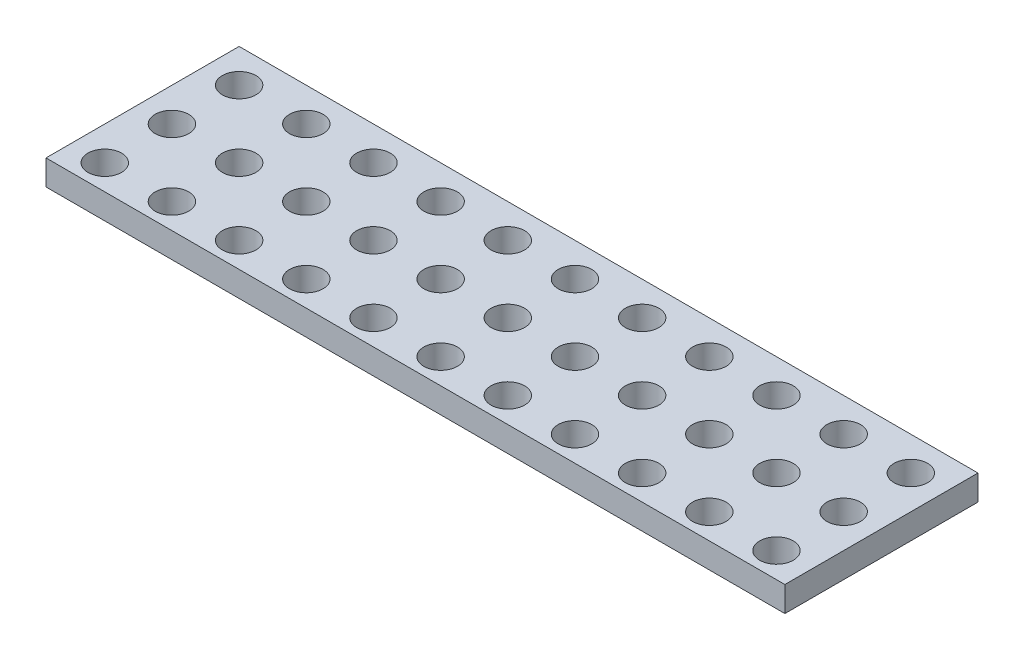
ISO-10303-21;
HEADER;
FILE_DESCRIPTION(('STEP AP214'),'2;1');
FILE_NAME('part.step','',(''),(''),'','','');
FILE_SCHEMA(('AUTOMOTIVE_DESIGN { 1 0 10303 214 1 1 1 1 }'));
ENDSEC;
DATA;
#1=APPLICATION_CONTEXT('core data for automotive mechanical design processes');
#2=APPLICATION_PROTOCOL_DEFINITION('international standard','automotive_design',2000,#1);
#3=PRODUCT_CONTEXT('',#1,'mechanical');
#4=PRODUCT('Part','Part','',(#3));
#5=PRODUCT_RELATED_PRODUCT_CATEGORY('part','',(#4));
#6=PRODUCT_DEFINITION_FORMATION('','',#4);
#7=PRODUCT_DEFINITION_CONTEXT('part definition',#1,'design');
#8=PRODUCT_DEFINITION('design','',#6,#7);
#9=PRODUCT_DEFINITION_SHAPE('','',#8);
#10=(LENGTH_UNIT() NAMED_UNIT(*) SI_UNIT(.MILLI.,.METRE.));
#11=(NAMED_UNIT(*) PLANE_ANGLE_UNIT() SI_UNIT($,.RADIAN.));
#12=(NAMED_UNIT(*) SI_UNIT($,.STERADIAN.) SOLID_ANGLE_UNIT());
#13=UNCERTAINTY_MEASURE_WITH_UNIT(LENGTH_MEASURE(1.E-05),#10,'distance_accuracy_value','');
#14=(GEOMETRIC_REPRESENTATION_CONTEXT(3) GLOBAL_UNCERTAINTY_ASSIGNED_CONTEXT((#13)) GLOBAL_UNIT_ASSIGNED_CONTEXT((#10,
#11,#12)) REPRESENTATION_CONTEXT('',''));
#15=CARTESIAN_POINT('',(0.,0.,0.));
#16=DIRECTION('',(0.,0.,1.));
#17=DIRECTION('',(1.,0.,0.));
#18=AXIS2_PLACEMENT_3D('',#15,#16,#17);
#19=CARTESIAN_POINT('',(0.,3.,0.));
#20=DIRECTION('',(0.,1.,0.));
#21=DIRECTION('',(0.,0.,1.));
#22=AXIS2_PLACEMENT_3D('',#19,#20,#21);
#23=PLANE('',#22);
#24=CARTESIAN_POINT('',(59.4074074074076,3.,8.29629629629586));
#25=DIRECTION('',(0.,1.,0.));
#26=DIRECTION('',(0.,0.,1.));
#27=AXIS2_PLACEMENT_3D('',#24,#25,#26);
#28=CIRCLE('',#27,2.);
#29=CARTESIAN_POINT('',(59.4074074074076,3.,10.2962962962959));
#30=VERTEX_POINT('',#29);
#31=EDGE_CURVE('E297',#30,#30,#28,.T.);
#32=ORIENTED_EDGE('',*,*,#31,.F.);
#33=EDGE_LOOP('',(#32));
#34=FACE_BOUND('',#33,.T.);
#35=CARTESIAN_POINT('',(43.4074074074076,3.,8.29629629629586));
#36=DIRECTION('',(0.,1.,0.));
#37=DIRECTION('',(0.,0.,1.));
#38=AXIS2_PLACEMENT_3D('',#35,#36,#37);
#39=CIRCLE('',#38,2.);
#40=CARTESIAN_POINT('',(43.4074074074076,3.,10.2962962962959));
#41=VERTEX_POINT('',#40);
#42=EDGE_CURVE('E285',#41,#41,#39,.T.);
#43=ORIENTED_EDGE('',*,*,#42,.F.);
#44=EDGE_LOOP('',(#43));
#45=FACE_BOUND('',#44,.T.);
#46=CARTESIAN_POINT('',(27.4074074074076,3.,8.2962962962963));
#47=DIRECTION('',(0.,1.,0.));
#48=DIRECTION('',(0.,0.,1.));
#49=AXIS2_PLACEMENT_3D('',#46,#47,#48);
#50=CIRCLE('',#49,2.);
#51=CARTESIAN_POINT('',(27.4074074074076,3.,10.2962962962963));
#52=VERTEX_POINT('',#51);
#53=EDGE_CURVE('E273',#52,#52,#50,.T.);
#54=ORIENTED_EDGE('',*,*,#53,.F.);
#55=EDGE_LOOP('',(#54));
#56=FACE_BOUND('',#55,.T.);
#57=CARTESIAN_POINT('',(11.4074074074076,3.,8.2962962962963));
#58=DIRECTION('',(0.,1.,0.));
#59=DIRECTION('',(0.,0.,1.));
#60=AXIS2_PLACEMENT_3D('',#57,#58,#59);
#61=CIRCLE('',#60,2.);
#62=CARTESIAN_POINT('',(11.4074074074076,3.,10.2962962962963));
#63=VERTEX_POINT('',#62);
#64=EDGE_CURVE('E261',#63,#63,#61,.T.);
#65=ORIENTED_EDGE('',*,*,#64,.F.);
#66=EDGE_LOOP('',(#65));
#67=FACE_BOUND('',#66,.T.);
#68=CARTESIAN_POINT('',(-4.59259259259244,3.,8.2962962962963));
#69=DIRECTION('',(0.,1.,0.));
#70=DIRECTION('',(0.,0.,1.));
#71=AXIS2_PLACEMENT_3D('',#68,#69,#70);
#72=CIRCLE('',#71,2.);
#73=CARTESIAN_POINT('',(-4.59259259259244,3.,10.2962962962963));
#74=VERTEX_POINT('',#73);
#75=EDGE_CURVE('E249',#74,#74,#72,.T.);
#76=ORIENTED_EDGE('',*,*,#75,.F.);
#77=EDGE_LOOP('',(#76));
#78=FACE_BOUND('',#77,.T.);
#79=CARTESIAN_POINT('',(-20.5925925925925,3.,0.296296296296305));
#80=DIRECTION('',(0.,1.,0.));
#81=DIRECTION('',(0.,0.,1.));
#82=AXIS2_PLACEMENT_3D('',#79,#80,#81);
#83=CIRCLE('',#82,2.);
#84=CARTESIAN_POINT('',(-20.5925925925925,3.,2.29629629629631));
#85=VERTEX_POINT('',#84);
#86=EDGE_CURVE('E237',#85,#85,#83,.T.);
#87=ORIENTED_EDGE('',*,*,#86,.F.);
#88=EDGE_LOOP('',(#87));
#89=FACE_BOUND('',#88,.T.);
#90=CARTESIAN_POINT('',(51.4074074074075,3.,0.296296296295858));
#91=DIRECTION('',(0.,1.,0.));
#92=DIRECTION('',(0.,0.,1.));
#93=AXIS2_PLACEMENT_3D('',#90,#91,#92);
#94=CIRCLE('',#93,2.);
#95=CARTESIAN_POINT('',(51.4074074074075,3.,2.29629629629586));
#96=VERTEX_POINT('',#95);
#97=EDGE_CURVE('E225',#96,#96,#94,.T.);
#98=ORIENTED_EDGE('',*,*,#97,.F.);
#99=EDGE_LOOP('',(#98));
#100=FACE_BOUND('',#99,.T.);
#101=CARTESIAN_POINT('',(35.4074074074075,3.,0.296296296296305));
#102=DIRECTION('',(0.,1.,0.));
#103=DIRECTION('',(0.,0.,1.));
#104=AXIS2_PLACEMENT_3D('',#101,#102,#103);
#105=CIRCLE('',#104,2.);
#106=CARTESIAN_POINT('',(35.4074074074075,3.,2.29629629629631));
#107=VERTEX_POINT('',#106);
#108=EDGE_CURVE('E213',#107,#107,#105,.T.);
#109=ORIENTED_EDGE('',*,*,#108,.F.);
#110=EDGE_LOOP('',(#109));
#111=FACE_BOUND('',#110,.T.);
#112=CARTESIAN_POINT('',(19.4074074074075,3.,0.296296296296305));
#113=DIRECTION('',(0.,1.,0.));
#114=DIRECTION('',(0.,0.,1.));
#115=AXIS2_PLACEMENT_3D('',#112,#113,#114);
#116=CIRCLE('',#115,2.);
#117=CARTESIAN_POINT('',(19.4074074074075,3.,2.29629629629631));
#118=VERTEX_POINT('',#117);
#119=EDGE_CURVE('E201',#118,#118,#116,.T.);
#120=ORIENTED_EDGE('',*,*,#119,.F.);
#121=EDGE_LOOP('',(#120));
#122=FACE_BOUND('',#121,.T.);
#123=CARTESIAN_POINT('',(3.40740740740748,3.,0.296296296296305));
#124=DIRECTION('',(0.,1.,0.));
#125=DIRECTION('',(0.,0.,1.));
#126=AXIS2_PLACEMENT_3D('',#123,#124,#125);
#127=CIRCLE('',#126,2.);
#128=CARTESIAN_POINT('',(3.40740740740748,3.,2.29629629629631));
#129=VERTEX_POINT('',#128);
#130=EDGE_CURVE('E189',#129,#129,#127,.T.);
#131=ORIENTED_EDGE('',*,*,#130,.F.);
#132=EDGE_LOOP('',(#131));
#133=FACE_BOUND('',#132,.T.);
#134=CARTESIAN_POINT('',(-12.5925925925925,3.,0.296296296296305));
#135=DIRECTION('',(0.,1.,0.));
#136=DIRECTION('',(0.,0.,1.));
#137=AXIS2_PLACEMENT_3D('',#134,#135,#136);
#138=CIRCLE('',#137,2.);
#139=CARTESIAN_POINT('',(-12.5925925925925,3.,2.29629629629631));
#140=VERTEX_POINT('',#139);
#141=EDGE_CURVE('E177',#140,#140,#138,.T.);
#142=ORIENTED_EDGE('',*,*,#141,.F.);
#143=EDGE_LOOP('',(#142));
#144=FACE_BOUND('',#143,.T.);
#145=CARTESIAN_POINT('',(51.4074074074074,3.,-7.70370370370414));
#146=DIRECTION('',(0.,1.,0.));
#147=DIRECTION('',(0.,0.,1.));
#148=AXIS2_PLACEMENT_3D('',#145,#146,#147);
#149=CIRCLE('',#148,2.);
#150=CARTESIAN_POINT('',(51.4074074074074,3.,-5.70370370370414));
#151=VERTEX_POINT('',#150);
#152=EDGE_CURVE('E165',#151,#151,#149,.T.);
#153=ORIENTED_EDGE('',*,*,#152,.F.);
#154=EDGE_LOOP('',(#153));
#155=FACE_BOUND('',#154,.T.);
#156=CARTESIAN_POINT('',(35.4074074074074,3.,-7.7037037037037));
#157=DIRECTION('',(0.,1.,0.));
#158=DIRECTION('',(0.,0.,1.));
#159=AXIS2_PLACEMENT_3D('',#156,#157,#158);
#160=CIRCLE('',#159,2.);
#161=CARTESIAN_POINT('',(35.4074074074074,3.,-5.70370370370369));
#162=VERTEX_POINT('',#161);
#163=EDGE_CURVE('E153',#162,#162,#160,.T.);
#164=ORIENTED_EDGE('',*,*,#163,.F.);
#165=EDGE_LOOP('',(#164));
#166=FACE_BOUND('',#165,.T.);
#167=CARTESIAN_POINT('',(19.4074074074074,3.,-7.7037037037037));
#168=DIRECTION('',(0.,1.,0.));
#169=DIRECTION('',(0.,0.,1.));
#170=AXIS2_PLACEMENT_3D('',#167,#168,#169);
#171=CIRCLE('',#170,2.);
#172=CARTESIAN_POINT('',(19.4074074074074,3.,-5.70370370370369));
#173=VERTEX_POINT('',#172);
#174=EDGE_CURVE('E141',#173,#173,#171,.T.);
#175=ORIENTED_EDGE('',*,*,#174,.F.);
#176=EDGE_LOOP('',(#175));
#177=FACE_BOUND('',#176,.T.);
#178=CARTESIAN_POINT('',(3.40740740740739,3.,-7.7037037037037));
#179=DIRECTION('',(0.,1.,0.));
#180=DIRECTION('',(0.,0.,1.));
#181=AXIS2_PLACEMENT_3D('',#178,#179,#180);
#182=CIRCLE('',#181,2.);
#183=CARTESIAN_POINT('',(3.40740740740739,3.,-5.70370370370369));
#184=VERTEX_POINT('',#183);
#185=EDGE_CURVE('E129',#184,#184,#182,.T.);
#186=ORIENTED_EDGE('',*,*,#185,.F.);
#187=EDGE_LOOP('',(#186));
#188=FACE_BOUND('',#187,.T.);
#189=CARTESIAN_POINT('',(-12.5925925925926,3.,-7.7037037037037));
#190=DIRECTION('',(0.,1.,0.));
#191=DIRECTION('',(0.,0.,1.));
#192=AXIS2_PLACEMENT_3D('',#189,#190,#191);
#193=CIRCLE('',#192,2.);
#194=CARTESIAN_POINT('',(-12.5925925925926,3.,-5.70370370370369));
#195=VERTEX_POINT('',#194);
#196=EDGE_CURVE('E117',#195,#195,#193,.T.);
#197=ORIENTED_EDGE('',*,*,#196,.F.);
#198=EDGE_LOOP('',(#197));
#199=FACE_BOUND('',#198,.T.);
#200=DIRECTION('',(0.,0.,1.));
#201=VECTOR('',#200,1.);
#202=CARTESIAN_POINT('',(-24.5925925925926,3.,-11.7037037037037));
#203=LINE('',#202,#201);
#204=CARTESIAN_POINT('',(-24.5925925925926,3.,-11.7037037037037));
#205=VERTEX_POINT('',#204);
#206=CARTESIAN_POINT('',(-24.5925925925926,3.,11.2962962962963));
#207=VERTEX_POINT('',#206);
#208=EDGE_CURVE('E87',#205,#207,#203,.T.);
#209=ORIENTED_EDGE('',*,*,#208,.T.);
#210=DIRECTION('',(1.,0.,0.));
#211=VECTOR('',#210,1.);
#212=CARTESIAN_POINT('',(-24.5925925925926,3.,11.2962962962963));
#213=LINE('',#212,#211);
#214=CARTESIAN_POINT('',(63.4074074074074,3.,11.2962962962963));
#215=VERTEX_POINT('',#214);
#216=EDGE_CURVE('E82',#207,#215,#213,.T.);
#217=ORIENTED_EDGE('',*,*,#216,.T.);
#218=DIRECTION('',(0.,0.,-1.));
#219=VECTOR('',#218,1.);
#220=CARTESIAN_POINT('',(63.4074074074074,3.,-11.7037037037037));
#221=LINE('',#220,#219);
#222=CARTESIAN_POINT('',(63.4074074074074,3.,-11.7037037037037));
#223=VERTEX_POINT('',#222);
#224=EDGE_CURVE('E85',#215,#223,#221,.T.);
#225=ORIENTED_EDGE('',*,*,#224,.T.);
#226=DIRECTION('',(-1.,0.,0.));
#227=VECTOR('',#226,1.);
#228=CARTESIAN_POINT('',(-24.5925925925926,3.,-11.7037037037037));
#229=LINE('',#228,#227);
#230=EDGE_CURVE('E52',#223,#205,#229,.T.);
#231=ORIENTED_EDGE('',*,*,#230,.T.);
#232=EDGE_LOOP('',(#209,#217,#225,#231));
#233=FACE_BOUND('',#232,.T.);
#234=CARTESIAN_POINT('',(-20.5925925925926,3.,-7.7037037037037));
#235=DIRECTION('',(0.,1.,0.));
#236=DIRECTION('',(0.,0.,1.));
#237=AXIS2_PLACEMENT_3D('',#234,#235,#236);
#238=CIRCLE('',#237,2.);
#239=CARTESIAN_POINT('',(-20.5925925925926,3.,-5.70370370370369));
#240=VERTEX_POINT('',#239);
#241=EDGE_CURVE('E102',#240,#240,#238,.T.);
#242=ORIENTED_EDGE('',*,*,#241,.F.);
#243=EDGE_LOOP('',(#242));
#244=FACE_BOUND('',#243,.T.);
#245=CARTESIAN_POINT('',(-4.59259259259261,3.,-7.7037037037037));
#246=DIRECTION('',(0.,1.,0.));
#247=DIRECTION('',(0.,0.,1.));
#248=AXIS2_PLACEMENT_3D('',#245,#246,#247);
#249=CIRCLE('',#248,2.);
#250=CARTESIAN_POINT('',(-4.59259259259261,3.,-5.70370370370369));
#251=VERTEX_POINT('',#250);
#252=EDGE_CURVE('E123',#251,#251,#249,.T.);
#253=ORIENTED_EDGE('',*,*,#252,.F.);
#254=EDGE_LOOP('',(#253));
#255=FACE_BOUND('',#254,.T.);
#256=CARTESIAN_POINT('',(11.4074074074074,3.,-7.7037037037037));
#257=DIRECTION('',(0.,1.,0.));
#258=DIRECTION('',(0.,0.,1.));
#259=AXIS2_PLACEMENT_3D('',#256,#257,#258);
#260=CIRCLE('',#259,2.);
#261=CARTESIAN_POINT('',(11.4074074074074,3.,-5.70370370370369));
#262=VERTEX_POINT('',#261);
#263=EDGE_CURVE('E135',#262,#262,#260,.T.);
#264=ORIENTED_EDGE('',*,*,#263,.F.);
#265=EDGE_LOOP('',(#264));
#266=FACE_BOUND('',#265,.T.);
#267=CARTESIAN_POINT('',(27.4074074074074,3.,-7.7037037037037));
#268=DIRECTION('',(0.,1.,0.));
#269=DIRECTION('',(0.,0.,1.));
#270=AXIS2_PLACEMENT_3D('',#267,#268,#269);
#271=CIRCLE('',#270,2.);
#272=CARTESIAN_POINT('',(27.4074074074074,3.,-5.70370370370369));
#273=VERTEX_POINT('',#272);
#274=EDGE_CURVE('E147',#273,#273,#271,.T.);
#275=ORIENTED_EDGE('',*,*,#274,.F.);
#276=EDGE_LOOP('',(#275));
#277=FACE_BOUND('',#276,.T.);
#278=CARTESIAN_POINT('',(43.4074074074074,3.,-7.70370370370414));
#279=DIRECTION('',(0.,1.,0.));
#280=DIRECTION('',(0.,0.,1.));
#281=AXIS2_PLACEMENT_3D('',#278,#279,#280);
#282=CIRCLE('',#281,2.);
#283=CARTESIAN_POINT('',(43.4074074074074,3.,-5.70370370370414));
#284=VERTEX_POINT('',#283);
#285=EDGE_CURVE('E159',#284,#284,#282,.T.);
#286=ORIENTED_EDGE('',*,*,#285,.F.);
#287=EDGE_LOOP('',(#286));
#288=FACE_BOUND('',#287,.T.);
#289=CARTESIAN_POINT('',(59.4074074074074,3.,-7.70370370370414));
#290=DIRECTION('',(0.,1.,0.));
#291=DIRECTION('',(0.,0.,1.));
#292=AXIS2_PLACEMENT_3D('',#289,#290,#291);
#293=CIRCLE('',#292,2.);
#294=CARTESIAN_POINT('',(59.4074074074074,3.,-5.70370370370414));
#295=VERTEX_POINT('',#294);
#296=EDGE_CURVE('E171',#295,#295,#293,.T.);
#297=ORIENTED_EDGE('',*,*,#296,.F.);
#298=EDGE_LOOP('',(#297));
#299=FACE_BOUND('',#298,.T.);
#300=CARTESIAN_POINT('',(-4.59259259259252,3.,0.296296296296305));
#301=DIRECTION('',(0.,1.,0.));
#302=DIRECTION('',(0.,0.,1.));
#303=AXIS2_PLACEMENT_3D('',#300,#301,#302);
#304=CIRCLE('',#303,2.);
#305=CARTESIAN_POINT('',(-4.59259259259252,3.,2.29629629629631));
#306=VERTEX_POINT('',#305);
#307=EDGE_CURVE('E183',#306,#306,#304,.T.);
#308=ORIENTED_EDGE('',*,*,#307,.F.);
#309=EDGE_LOOP('',(#308));
#310=FACE_BOUND('',#309,.T.);
#311=CARTESIAN_POINT('',(11.4074074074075,3.,0.296296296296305));
#312=DIRECTION('',(0.,1.,0.));
#313=DIRECTION('',(0.,0.,1.));
#314=AXIS2_PLACEMENT_3D('',#311,#312,#313);
#315=CIRCLE('',#314,2.);
#316=CARTESIAN_POINT('',(11.4074074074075,3.,2.29629629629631));
#317=VERTEX_POINT('',#316);
#318=EDGE_CURVE('E195',#317,#317,#315,.T.);
#319=ORIENTED_EDGE('',*,*,#318,.F.);
#320=EDGE_LOOP('',(#319));
#321=FACE_BOUND('',#320,.T.);
#322=CARTESIAN_POINT('',(27.4074074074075,3.,0.296296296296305));
#323=DIRECTION('',(0.,1.,0.));
#324=DIRECTION('',(0.,0.,1.));
#325=AXIS2_PLACEMENT_3D('',#322,#323,#324);
#326=CIRCLE('',#325,2.);
#327=CARTESIAN_POINT('',(27.4074074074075,3.,2.29629629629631));
#328=VERTEX_POINT('',#327);
#329=EDGE_CURVE('E207',#328,#328,#326,.T.);
#330=ORIENTED_EDGE('',*,*,#329,.F.);
#331=EDGE_LOOP('',(#330));
#332=FACE_BOUND('',#331,.T.);
#333=CARTESIAN_POINT('',(43.4074074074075,3.,0.296296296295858));
#334=DIRECTION('',(0.,1.,0.));
#335=DIRECTION('',(0.,0.,1.));
#336=AXIS2_PLACEMENT_3D('',#333,#334,#335);
#337=CIRCLE('',#336,2.);
#338=CARTESIAN_POINT('',(43.4074074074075,3.,2.29629629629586));
#339=VERTEX_POINT('',#338);
#340=EDGE_CURVE('E219',#339,#339,#337,.T.);
#341=ORIENTED_EDGE('',*,*,#340,.F.);
#342=EDGE_LOOP('',(#341));
#343=FACE_BOUND('',#342,.T.);
#344=CARTESIAN_POINT('',(59.4074074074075,3.,0.296296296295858));
#345=DIRECTION('',(0.,1.,0.));
#346=DIRECTION('',(0.,0.,1.));
#347=AXIS2_PLACEMENT_3D('',#344,#345,#346);
#348=CIRCLE('',#347,2.);
#349=CARTESIAN_POINT('',(59.4074074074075,3.,2.29629629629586));
#350=VERTEX_POINT('',#349);
#351=EDGE_CURVE('E231',#350,#350,#348,.T.);
#352=ORIENTED_EDGE('',*,*,#351,.F.);
#353=EDGE_LOOP('',(#352));
#354=FACE_BOUND('',#353,.T.);
#355=CARTESIAN_POINT('',(-12.5925925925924,3.,8.2962962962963));
#356=DIRECTION('',(0.,1.,0.));
#357=DIRECTION('',(0.,0.,1.));
#358=AXIS2_PLACEMENT_3D('',#355,#356,#357);
#359=CIRCLE('',#358,2.);
#360=CARTESIAN_POINT('',(-12.5925925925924,3.,10.2962962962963));
#361=VERTEX_POINT('',#360);
#362=EDGE_CURVE('E243',#361,#361,#359,.T.);
#363=ORIENTED_EDGE('',*,*,#362,.F.);
#364=EDGE_LOOP('',(#363));
#365=FACE_BOUND('',#364,.T.);
#366=CARTESIAN_POINT('',(3.40740740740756,3.,8.2962962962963));
#367=DIRECTION('',(0.,1.,0.));
#368=DIRECTION('',(0.,0.,1.));
#369=AXIS2_PLACEMENT_3D('',#366,#367,#368);
#370=CIRCLE('',#369,2.);
#371=CARTESIAN_POINT('',(3.40740740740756,3.,10.2962962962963));
#372=VERTEX_POINT('',#371);
#373=EDGE_CURVE('E255',#372,#372,#370,.T.);
#374=ORIENTED_EDGE('',*,*,#373,.F.);
#375=EDGE_LOOP('',(#374));
#376=FACE_BOUND('',#375,.T.);
#377=CARTESIAN_POINT('',(19.4074074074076,3.,8.2962962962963));
#378=DIRECTION('',(0.,1.,0.));
#379=DIRECTION('',(0.,0.,1.));
#380=AXIS2_PLACEMENT_3D('',#377,#378,#379);
#381=CIRCLE('',#380,2.);
#382=CARTESIAN_POINT('',(19.4074074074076,3.,10.2962962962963));
#383=VERTEX_POINT('',#382);
#384=EDGE_CURVE('E267',#383,#383,#381,.T.);
#385=ORIENTED_EDGE('',*,*,#384,.F.);
#386=EDGE_LOOP('',(#385));
#387=FACE_BOUND('',#386,.T.);
#388=CARTESIAN_POINT('',(35.4074074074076,3.,8.2962962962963));
#389=DIRECTION('',(0.,1.,0.));
#390=DIRECTION('',(0.,0.,1.));
#391=AXIS2_PLACEMENT_3D('',#388,#389,#390);
#392=CIRCLE('',#391,2.);
#393=CARTESIAN_POINT('',(35.4074074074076,3.,10.2962962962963));
#394=VERTEX_POINT('',#393);
#395=EDGE_CURVE('E279',#394,#394,#392,.T.);
#396=ORIENTED_EDGE('',*,*,#395,.F.);
#397=EDGE_LOOP('',(#396));
#398=FACE_BOUND('',#397,.T.);
#399=CARTESIAN_POINT('',(51.4074074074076,3.,8.29629629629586));
#400=DIRECTION('',(0.,1.,0.));
#401=DIRECTION('',(0.,0.,1.));
#402=AXIS2_PLACEMENT_3D('',#399,#400,#401);
#403=CIRCLE('',#402,2.);
#404=CARTESIAN_POINT('',(51.4074074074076,3.,10.2962962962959));
#405=VERTEX_POINT('',#404);
#406=EDGE_CURVE('E291',#405,#405,#403,.T.);
#407=ORIENTED_EDGE('',*,*,#406,.F.);
#408=EDGE_LOOP('',(#407));
#409=FACE_BOUND('',#408,.T.);
#410=CARTESIAN_POINT('',(-20.5925925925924,3.,8.2962962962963));
#411=DIRECTION('',(0.,1.,0.));
#412=DIRECTION('',(0.,0.,1.));
#413=AXIS2_PLACEMENT_3D('',#410,#411,#412);
#414=CIRCLE('',#413,2.);
#415=CARTESIAN_POINT('',(-20.5925925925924,3.,10.2962962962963));
#416=VERTEX_POINT('',#415);
#417=EDGE_CURVE('E303',#416,#416,#414,.T.);
#418=ORIENTED_EDGE('',*,*,#417,.F.);
#419=EDGE_LOOP('',(#418));
#420=FACE_BOUND('',#419,.T.);
#421=ADVANCED_FACE('F35',(#34,#45,#56,#67,#78,#89,#100,#111,#122,#133,#144,#155,#166,#177,#188,
#199,#233,#244,#255,#266,#277,#288,#299,#310,#321,#332,#343,#354,#365,#376,#387,#398,#409,#420),
#23,.T.);
#422=CARTESIAN_POINT('',(0.,0.,0.));
#423=DIRECTION('',(0.,1.,0.));
#424=DIRECTION('',(0.,0.,1.));
#425=AXIS2_PLACEMENT_3D('',#422,#423,#424);
#426=PLANE('',#425);
#427=DIRECTION('',(0.,0.,1.));
#428=VECTOR('',#427,1.);
#429=CARTESIAN_POINT('',(-24.5925925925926,0.,-11.7037037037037));
#430=LINE('',#429,#428);
#431=CARTESIAN_POINT('',(-24.5925925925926,0.,-11.7037037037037));
#432=VERTEX_POINT('',#431);
#433=CARTESIAN_POINT('',(-24.5925925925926,0.,11.2962962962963));
#434=VERTEX_POINT('',#433);
#435=EDGE_CURVE('E99',#432,#434,#430,.T.);
#436=ORIENTED_EDGE('',*,*,#435,.F.);
#437=DIRECTION('',(-1.,0.,0.));
#438=VECTOR('',#437,1.);
#439=CARTESIAN_POINT('',(-24.5925925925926,0.,-11.7037037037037));
#440=LINE('',#439,#438);
#441=CARTESIAN_POINT('',(63.4074074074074,0.,-11.7037037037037));
#442=VERTEX_POINT('',#441);
#443=EDGE_CURVE('E75',#442,#432,#440,.T.);
#444=ORIENTED_EDGE('',*,*,#443,.F.);
#445=DIRECTION('',(0.,0.,-1.));
#446=VECTOR('',#445,1.);
#447=CARTESIAN_POINT('',(63.4074074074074,0.,-11.7037037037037));
#448=LINE('',#447,#446);
#449=CARTESIAN_POINT('',(63.4074074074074,0.,11.2962962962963));
#450=VERTEX_POINT('',#449);
#451=EDGE_CURVE('E69',#450,#442,#448,.T.);
#452=ORIENTED_EDGE('',*,*,#451,.F.);
#453=DIRECTION('',(1.,0.,0.));
#454=VECTOR('',#453,1.);
#455=CARTESIAN_POINT('',(-24.5925925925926,0.,11.2962962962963));
#456=LINE('',#455,#454);
#457=EDGE_CURVE('E91',#434,#450,#456,.T.);
#458=ORIENTED_EDGE('',*,*,#457,.F.);
#459=EDGE_LOOP('',(#436,#444,#452,#458));
#460=FACE_BOUND('',#459,.T.);
#461=CARTESIAN_POINT('',(-20.5925925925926,0.,-7.7037037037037));
#462=DIRECTION('',(0.,1.,0.));
#463=DIRECTION('',(0.,0.,1.));
#464=AXIS2_PLACEMENT_3D('',#461,#462,#463);
#465=CIRCLE('',#464,2.);
#466=CARTESIAN_POINT('',(-20.5925925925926,0.,-5.70370370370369));
#467=VERTEX_POINT('',#466);
#468=EDGE_CURVE('E114',#467,#467,#465,.T.);
#469=ORIENTED_EDGE('',*,*,#468,.T.);
#470=EDGE_LOOP('',(#469));
#471=FACE_BOUND('',#470,.T.);
#472=CARTESIAN_POINT('',(-12.5925925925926,0.,-7.7037037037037));
#473=DIRECTION('',(0.,1.,0.));
#474=DIRECTION('',(0.,0.,1.));
#475=AXIS2_PLACEMENT_3D('',#472,#473,#474);
#476=CIRCLE('',#475,2.);
#477=CARTESIAN_POINT('',(-12.5925925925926,0.,-5.70370370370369));
#478=VERTEX_POINT('',#477);
#479=EDGE_CURVE('E120',#478,#478,#476,.T.);
#480=ORIENTED_EDGE('',*,*,#479,.T.);
#481=EDGE_LOOP('',(#480));
#482=FACE_BOUND('',#481,.T.);
#483=CARTESIAN_POINT('',(-4.59259259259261,0.,-7.7037037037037));
#484=DIRECTION('',(0.,1.,0.));
#485=DIRECTION('',(0.,0.,1.));
#486=AXIS2_PLACEMENT_3D('',#483,#484,#485);
#487=CIRCLE('',#486,2.);
#488=CARTESIAN_POINT('',(-4.59259259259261,0.,-5.70370370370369));
#489=VERTEX_POINT('',#488);
#490=EDGE_CURVE('E126',#489,#489,#487,.T.);
#491=ORIENTED_EDGE('',*,*,#490,.T.);
#492=EDGE_LOOP('',(#491));
#493=FACE_BOUND('',#492,.T.);
#494=CARTESIAN_POINT('',(3.40740740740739,0.,-7.7037037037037));
#495=DIRECTION('',(0.,1.,0.));
#496=DIRECTION('',(0.,0.,1.));
#497=AXIS2_PLACEMENT_3D('',#494,#495,#496);
#498=CIRCLE('',#497,2.);
#499=CARTESIAN_POINT('',(3.40740740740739,0.,-5.70370370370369));
#500=VERTEX_POINT('',#499);
#501=EDGE_CURVE('E132',#500,#500,#498,.T.);
#502=ORIENTED_EDGE('',*,*,#501,.T.);
#503=EDGE_LOOP('',(#502));
#504=FACE_BOUND('',#503,.T.);
#505=CARTESIAN_POINT('',(11.4074074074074,0.,-7.7037037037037));
#506=DIRECTION('',(0.,1.,0.));
#507=DIRECTION('',(0.,0.,1.));
#508=AXIS2_PLACEMENT_3D('',#505,#506,#507);
#509=CIRCLE('',#508,2.);
#510=CARTESIAN_POINT('',(11.4074074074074,0.,-5.70370370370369));
#511=VERTEX_POINT('',#510);
#512=EDGE_CURVE('E138',#511,#511,#509,.T.);
#513=ORIENTED_EDGE('',*,*,#512,.T.);
#514=EDGE_LOOP('',(#513));
#515=FACE_BOUND('',#514,.T.);
#516=CARTESIAN_POINT('',(19.4074074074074,0.,-7.7037037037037));
#517=DIRECTION('',(0.,1.,0.));
#518=DIRECTION('',(0.,0.,1.));
#519=AXIS2_PLACEMENT_3D('',#516,#517,#518);
#520=CIRCLE('',#519,2.);
#521=CARTESIAN_POINT('',(19.4074074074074,0.,-5.70370370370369));
#522=VERTEX_POINT('',#521);
#523=EDGE_CURVE('E144',#522,#522,#520,.T.);
#524=ORIENTED_EDGE('',*,*,#523,.T.);
#525=EDGE_LOOP('',(#524));
#526=FACE_BOUND('',#525,.T.);
#527=CARTESIAN_POINT('',(27.4074074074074,0.,-7.7037037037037));
#528=DIRECTION('',(0.,1.,0.));
#529=DIRECTION('',(0.,0.,1.));
#530=AXIS2_PLACEMENT_3D('',#527,#528,#529);
#531=CIRCLE('',#530,2.);
#532=CARTESIAN_POINT('',(27.4074074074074,0.,-5.70370370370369));
#533=VERTEX_POINT('',#532);
#534=EDGE_CURVE('E150',#533,#533,#531,.T.);
#535=ORIENTED_EDGE('',*,*,#534,.T.);
#536=EDGE_LOOP('',(#535));
#537=FACE_BOUND('',#536,.T.);
#538=CARTESIAN_POINT('',(35.4074074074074,0.,-7.7037037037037));
#539=DIRECTION('',(0.,1.,0.));
#540=DIRECTION('',(0.,0.,1.));
#541=AXIS2_PLACEMENT_3D('',#538,#539,#540);
#542=CIRCLE('',#541,2.);
#543=CARTESIAN_POINT('',(35.4074074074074,0.,-5.70370370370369));
#544=VERTEX_POINT('',#543);
#545=EDGE_CURVE('E156',#544,#544,#542,.T.);
#546=ORIENTED_EDGE('',*,*,#545,.T.);
#547=EDGE_LOOP('',(#546));
#548=FACE_BOUND('',#547,.T.);
#549=CARTESIAN_POINT('',(43.4074074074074,0.,-7.70370370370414));
#550=DIRECTION('',(0.,1.,0.));
#551=DIRECTION('',(0.,0.,1.));
#552=AXIS2_PLACEMENT_3D('',#549,#550,#551);
#553=CIRCLE('',#552,2.);
#554=CARTESIAN_POINT('',(43.4074074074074,0.,-5.70370370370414));
#555=VERTEX_POINT('',#554);
#556=EDGE_CURVE('E162',#555,#555,#553,.T.);
#557=ORIENTED_EDGE('',*,*,#556,.T.);
#558=EDGE_LOOP('',(#557));
#559=FACE_BOUND('',#558,.T.);
#560=CARTESIAN_POINT('',(51.4074074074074,0.,-7.70370370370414));
#561=DIRECTION('',(0.,1.,0.));
#562=DIRECTION('',(0.,0.,1.));
#563=AXIS2_PLACEMENT_3D('',#560,#561,#562);
#564=CIRCLE('',#563,2.);
#565=CARTESIAN_POINT('',(51.4074074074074,0.,-5.70370370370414));
#566=VERTEX_POINT('',#565);
#567=EDGE_CURVE('E168',#566,#566,#564,.T.);
#568=ORIENTED_EDGE('',*,*,#567,.T.);
#569=EDGE_LOOP('',(#568));
#570=FACE_BOUND('',#569,.T.);
#571=CARTESIAN_POINT('',(59.4074074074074,0.,-7.70370370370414));
#572=DIRECTION('',(0.,1.,0.));
#573=DIRECTION('',(0.,0.,1.));
#574=AXIS2_PLACEMENT_3D('',#571,#572,#573);
#575=CIRCLE('',#574,2.);
#576=CARTESIAN_POINT('',(59.4074074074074,0.,-5.70370370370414));
#577=VERTEX_POINT('',#576);
#578=EDGE_CURVE('E174',#577,#577,#575,.T.);
#579=ORIENTED_EDGE('',*,*,#578,.T.);
#580=EDGE_LOOP('',(#579));
#581=FACE_BOUND('',#580,.T.);
#582=CARTESIAN_POINT('',(-12.5925925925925,0.,0.296296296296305));
#583=DIRECTION('',(0.,1.,0.));
#584=DIRECTION('',(0.,0.,1.));
#585=AXIS2_PLACEMENT_3D('',#582,#583,#584);
#586=CIRCLE('',#585,2.);
#587=CARTESIAN_POINT('',(-12.5925925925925,0.,2.29629629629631));
#588=VERTEX_POINT('',#587);
#589=EDGE_CURVE('E180',#588,#588,#586,.T.);
#590=ORIENTED_EDGE('',*,*,#589,.T.);
#591=EDGE_LOOP('',(#590));
#592=FACE_BOUND('',#591,.T.);
#593=CARTESIAN_POINT('',(-4.59259259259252,0.,0.296296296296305));
#594=DIRECTION('',(0.,1.,0.));
#595=DIRECTION('',(0.,0.,1.));
#596=AXIS2_PLACEMENT_3D('',#593,#594,#595);
#597=CIRCLE('',#596,2.);
#598=CARTESIAN_POINT('',(-4.59259259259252,0.,2.29629629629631));
#599=VERTEX_POINT('',#598);
#600=EDGE_CURVE('E186',#599,#599,#597,.T.);
#601=ORIENTED_EDGE('',*,*,#600,.T.);
#602=EDGE_LOOP('',(#601));
#603=FACE_BOUND('',#602,.T.);
#604=CARTESIAN_POINT('',(3.40740740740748,0.,0.296296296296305));
#605=DIRECTION('',(0.,1.,0.));
#606=DIRECTION('',(0.,0.,1.));
#607=AXIS2_PLACEMENT_3D('',#604,#605,#606);
#608=CIRCLE('',#607,2.);
#609=CARTESIAN_POINT('',(3.40740740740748,0.,2.29629629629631));
#610=VERTEX_POINT('',#609);
#611=EDGE_CURVE('E192',#610,#610,#608,.T.);
#612=ORIENTED_EDGE('',*,*,#611,.T.);
#613=EDGE_LOOP('',(#612));
#614=FACE_BOUND('',#613,.T.);
#615=CARTESIAN_POINT('',(11.4074074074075,0.,0.296296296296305));
#616=DIRECTION('',(0.,1.,0.));
#617=DIRECTION('',(0.,0.,1.));
#618=AXIS2_PLACEMENT_3D('',#615,#616,#617);
#619=CIRCLE('',#618,2.);
#620=CARTESIAN_POINT('',(11.4074074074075,0.,2.29629629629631));
#621=VERTEX_POINT('',#620);
#622=EDGE_CURVE('E198',#621,#621,#619,.T.);
#623=ORIENTED_EDGE('',*,*,#622,.T.);
#624=EDGE_LOOP('',(#623));
#625=FACE_BOUND('',#624,.T.);
#626=CARTESIAN_POINT('',(19.4074074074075,0.,0.296296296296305));
#627=DIRECTION('',(0.,1.,0.));
#628=DIRECTION('',(0.,0.,1.));
#629=AXIS2_PLACEMENT_3D('',#626,#627,#628);
#630=CIRCLE('',#629,2.);
#631=CARTESIAN_POINT('',(19.4074074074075,0.,2.29629629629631));
#632=VERTEX_POINT('',#631);
#633=EDGE_CURVE('E204',#632,#632,#630,.T.);
#634=ORIENTED_EDGE('',*,*,#633,.T.);
#635=EDGE_LOOP('',(#634));
#636=FACE_BOUND('',#635,.T.);
#637=CARTESIAN_POINT('',(27.4074074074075,0.,0.296296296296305));
#638=DIRECTION('',(0.,1.,0.));
#639=DIRECTION('',(0.,0.,1.));
#640=AXIS2_PLACEMENT_3D('',#637,#638,#639);
#641=CIRCLE('',#640,2.);
#642=CARTESIAN_POINT('',(27.4074074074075,0.,2.29629629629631));
#643=VERTEX_POINT('',#642);
#644=EDGE_CURVE('E210',#643,#643,#641,.T.);
#645=ORIENTED_EDGE('',*,*,#644,.T.);
#646=EDGE_LOOP('',(#645));
#647=FACE_BOUND('',#646,.T.);
#648=CARTESIAN_POINT('',(35.4074074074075,0.,0.296296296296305));
#649=DIRECTION('',(0.,1.,0.));
#650=DIRECTION('',(0.,0.,1.));
#651=AXIS2_PLACEMENT_3D('',#648,#649,#650);
#652=CIRCLE('',#651,2.);
#653=CARTESIAN_POINT('',(35.4074074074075,0.,2.29629629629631));
#654=VERTEX_POINT('',#653);
#655=EDGE_CURVE('E216',#654,#654,#652,.T.);
#656=ORIENTED_EDGE('',*,*,#655,.T.);
#657=EDGE_LOOP('',(#656));
#658=FACE_BOUND('',#657,.T.);
#659=CARTESIAN_POINT('',(43.4074074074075,0.,0.296296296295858));
#660=DIRECTION('',(0.,1.,0.));
#661=DIRECTION('',(0.,0.,1.));
#662=AXIS2_PLACEMENT_3D('',#659,#660,#661);
#663=CIRCLE('',#662,2.);
#664=CARTESIAN_POINT('',(43.4074074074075,0.,2.29629629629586));
#665=VERTEX_POINT('',#664);
#666=EDGE_CURVE('E222',#665,#665,#663,.T.);
#667=ORIENTED_EDGE('',*,*,#666,.T.);
#668=EDGE_LOOP('',(#667));
#669=FACE_BOUND('',#668,.T.);
#670=CARTESIAN_POINT('',(51.4074074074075,0.,0.296296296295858));
#671=DIRECTION('',(0.,1.,0.));
#672=DIRECTION('',(0.,0.,1.));
#673=AXIS2_PLACEMENT_3D('',#670,#671,#672);
#674=CIRCLE('',#673,2.);
#675=CARTESIAN_POINT('',(51.4074074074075,0.,2.29629629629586));
#676=VERTEX_POINT('',#675);
#677=EDGE_CURVE('E228',#676,#676,#674,.T.);
#678=ORIENTED_EDGE('',*,*,#677,.T.);
#679=EDGE_LOOP('',(#678));
#680=FACE_BOUND('',#679,.T.);
#681=CARTESIAN_POINT('',(59.4074074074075,0.,0.296296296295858));
#682=DIRECTION('',(0.,1.,0.));
#683=DIRECTION('',(0.,0.,1.));
#684=AXIS2_PLACEMENT_3D('',#681,#682,#683);
#685=CIRCLE('',#684,2.);
#686=CARTESIAN_POINT('',(59.4074074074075,0.,2.29629629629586));
#687=VERTEX_POINT('',#686);
#688=EDGE_CURVE('E234',#687,#687,#685,.T.);
#689=ORIENTED_EDGE('',*,*,#688,.T.);
#690=EDGE_LOOP('',(#689));
#691=FACE_BOUND('',#690,.T.);
#692=CARTESIAN_POINT('',(-20.5925925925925,0.,0.296296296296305));
#693=DIRECTION('',(0.,1.,0.));
#694=DIRECTION('',(0.,0.,1.));
#695=AXIS2_PLACEMENT_3D('',#692,#693,#694);
#696=CIRCLE('',#695,2.);
#697=CARTESIAN_POINT('',(-20.5925925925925,0.,2.29629629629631));
#698=VERTEX_POINT('',#697);
#699=EDGE_CURVE('E240',#698,#698,#696,.T.);
#700=ORIENTED_EDGE('',*,*,#699,.T.);
#701=EDGE_LOOP('',(#700));
#702=FACE_BOUND('',#701,.T.);
#703=CARTESIAN_POINT('',(-12.5925925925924,0.,8.2962962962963));
#704=DIRECTION('',(0.,1.,0.));
#705=DIRECTION('',(0.,0.,1.));
#706=AXIS2_PLACEMENT_3D('',#703,#704,#705);
#707=CIRCLE('',#706,2.);
#708=CARTESIAN_POINT('',(-12.5925925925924,0.,10.2962962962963));
#709=VERTEX_POINT('',#708);
#710=EDGE_CURVE('E246',#709,#709,#707,.T.);
#711=ORIENTED_EDGE('',*,*,#710,.T.);
#712=EDGE_LOOP('',(#711));
#713=FACE_BOUND('',#712,.T.);
#714=CARTESIAN_POINT('',(-4.59259259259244,0.,8.2962962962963));
#715=DIRECTION('',(0.,1.,0.));
#716=DIRECTION('',(0.,0.,1.));
#717=AXIS2_PLACEMENT_3D('',#714,#715,#716);
#718=CIRCLE('',#717,2.);
#719=CARTESIAN_POINT('',(-4.59259259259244,0.,10.2962962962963));
#720=VERTEX_POINT('',#719);
#721=EDGE_CURVE('E252',#720,#720,#718,.T.);
#722=ORIENTED_EDGE('',*,*,#721,.T.);
#723=EDGE_LOOP('',(#722));
#724=FACE_BOUND('',#723,.T.);
#725=CARTESIAN_POINT('',(3.40740740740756,0.,8.2962962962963));
#726=DIRECTION('',(0.,1.,0.));
#727=DIRECTION('',(0.,0.,1.));
#728=AXIS2_PLACEMENT_3D('',#725,#726,#727);
#729=CIRCLE('',#728,2.);
#730=CARTESIAN_POINT('',(3.40740740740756,0.,10.2962962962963));
#731=VERTEX_POINT('',#730);
#732=EDGE_CURVE('E258',#731,#731,#729,.T.);
#733=ORIENTED_EDGE('',*,*,#732,.T.);
#734=EDGE_LOOP('',(#733));
#735=FACE_BOUND('',#734,.T.);
#736=CARTESIAN_POINT('',(11.4074074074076,0.,8.2962962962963));
#737=DIRECTION('',(0.,1.,0.));
#738=DIRECTION('',(0.,0.,1.));
#739=AXIS2_PLACEMENT_3D('',#736,#737,#738);
#740=CIRCLE('',#739,2.);
#741=CARTESIAN_POINT('',(11.4074074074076,0.,10.2962962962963));
#742=VERTEX_POINT('',#741);
#743=EDGE_CURVE('E264',#742,#742,#740,.T.);
#744=ORIENTED_EDGE('',*,*,#743,.T.);
#745=EDGE_LOOP('',(#744));
#746=FACE_BOUND('',#745,.T.);
#747=CARTESIAN_POINT('',(19.4074074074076,0.,8.2962962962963));
#748=DIRECTION('',(0.,1.,0.));
#749=DIRECTION('',(0.,0.,1.));
#750=AXIS2_PLACEMENT_3D('',#747,#748,#749);
#751=CIRCLE('',#750,2.);
#752=CARTESIAN_POINT('',(19.4074074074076,0.,10.2962962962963));
#753=VERTEX_POINT('',#752);
#754=EDGE_CURVE('E270',#753,#753,#751,.T.);
#755=ORIENTED_EDGE('',*,*,#754,.T.);
#756=EDGE_LOOP('',(#755));
#757=FACE_BOUND('',#756,.T.);
#758=CARTESIAN_POINT('',(27.4074074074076,0.,8.2962962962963));
#759=DIRECTION('',(0.,1.,0.));
#760=DIRECTION('',(0.,0.,1.));
#761=AXIS2_PLACEMENT_3D('',#758,#759,#760);
#762=CIRCLE('',#761,2.);
#763=CARTESIAN_POINT('',(27.4074074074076,0.,10.2962962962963));
#764=VERTEX_POINT('',#763);
#765=EDGE_CURVE('E276',#764,#764,#762,.T.);
#766=ORIENTED_EDGE('',*,*,#765,.T.);
#767=EDGE_LOOP('',(#766));
#768=FACE_BOUND('',#767,.T.);
#769=CARTESIAN_POINT('',(35.4074074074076,0.,8.2962962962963));
#770=DIRECTION('',(0.,1.,0.));
#771=DIRECTION('',(0.,0.,1.));
#772=AXIS2_PLACEMENT_3D('',#769,#770,#771);
#773=CIRCLE('',#772,2.);
#774=CARTESIAN_POINT('',(35.4074074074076,0.,10.2962962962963));
#775=VERTEX_POINT('',#774);
#776=EDGE_CURVE('E282',#775,#775,#773,.T.);
#777=ORIENTED_EDGE('',*,*,#776,.T.);
#778=EDGE_LOOP('',(#777));
#779=FACE_BOUND('',#778,.T.);
#780=CARTESIAN_POINT('',(43.4074074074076,0.,8.29629629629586));
#781=DIRECTION('',(0.,1.,0.));
#782=DIRECTION('',(0.,0.,1.));
#783=AXIS2_PLACEMENT_3D('',#780,#781,#782);
#784=CIRCLE('',#783,2.);
#785=CARTESIAN_POINT('',(43.4074074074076,0.,10.2962962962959));
#786=VERTEX_POINT('',#785);
#787=EDGE_CURVE('E288',#786,#786,#784,.T.);
#788=ORIENTED_EDGE('',*,*,#787,.T.);
#789=EDGE_LOOP('',(#788));
#790=FACE_BOUND('',#789,.T.);
#791=CARTESIAN_POINT('',(51.4074074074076,0.,8.29629629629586));
#792=DIRECTION('',(0.,1.,0.));
#793=DIRECTION('',(0.,0.,1.));
#794=AXIS2_PLACEMENT_3D('',#791,#792,#793);
#795=CIRCLE('',#794,2.);
#796=CARTESIAN_POINT('',(51.4074074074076,0.,10.2962962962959));
#797=VERTEX_POINT('',#796);
#798=EDGE_CURVE('E294',#797,#797,#795,.T.);
#799=ORIENTED_EDGE('',*,*,#798,.T.);
#800=EDGE_LOOP('',(#799));
#801=FACE_BOUND('',#800,.T.);
#802=CARTESIAN_POINT('',(59.4074074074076,0.,8.29629629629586));
#803=DIRECTION('',(0.,1.,0.));
#804=DIRECTION('',(0.,0.,1.));
#805=AXIS2_PLACEMENT_3D('',#802,#803,#804);
#806=CIRCLE('',#805,2.);
#807=CARTESIAN_POINT('',(59.4074074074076,0.,10.2962962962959));
#808=VERTEX_POINT('',#807);
#809=EDGE_CURVE('E300',#808,#808,#806,.T.);
#810=ORIENTED_EDGE('',*,*,#809,.T.);
#811=EDGE_LOOP('',(#810));
#812=FACE_BOUND('',#811,.T.);
#813=CARTESIAN_POINT('',(-20.5925925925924,0.,8.2962962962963));
#814=DIRECTION('',(0.,1.,0.));
#815=DIRECTION('',(0.,0.,1.));
#816=AXIS2_PLACEMENT_3D('',#813,#814,#815);
#817=CIRCLE('',#816,2.);
#818=CARTESIAN_POINT('',(-20.5925925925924,0.,10.2962962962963));
#819=VERTEX_POINT('',#818);
#820=EDGE_CURVE('E306',#819,#819,#817,.T.);
#821=ORIENTED_EDGE('',*,*,#820,.T.);
#822=EDGE_LOOP('',(#821));
#823=FACE_BOUND('',#822,.T.);
#824=ADVANCED_FACE('F110',(#460,#471,#482,#493,#504,#515,#526,#537,#548,#559,#570,#581,#592,
#603,#614,#625,#636,#647,#658,#669,#680,#691,#702,#713,#724,#735,#746,#757,#768,#779,#790,#801,
#812,#823),#426,.F.);
#825=CARTESIAN_POINT('',(-24.5925925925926,3.,-11.7037037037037));
#826=DIRECTION('',(1.,0.,0.));
#827=DIRECTION('',(0.,0.,-1.));
#828=AXIS2_PLACEMENT_3D('',#825,#826,#827);
#829=PLANE('',#828);
#830=ORIENTED_EDGE('',*,*,#435,.T.);
#831=DIRECTION('',(0.,-1.,0.));
#832=VECTOR('',#831,1.);
#833=CARTESIAN_POINT('',(-24.5925925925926,3.,11.2962962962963));
#834=LINE('',#833,#832);
#835=EDGE_CURVE('E11',#207,#434,#834,.T.);
#836=ORIENTED_EDGE('',*,*,#835,.F.);
#837=ORIENTED_EDGE('',*,*,#208,.F.);
#838=DIRECTION('',(0.,-1.,0.));
#839=VECTOR('',#838,1.);
#840=CARTESIAN_POINT('',(-24.5925925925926,3.,-11.7037037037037));
#841=LINE('',#840,#839);
#842=EDGE_CURVE('E95',#205,#432,#841,.T.);
#843=ORIENTED_EDGE('',*,*,#842,.T.);
#844=EDGE_LOOP('',(#830,#836,#837,#843));
#845=FACE_BOUND('',#844,.T.);
#846=ADVANCED_FACE('F37',(#845),#829,.F.);
#847=CARTESIAN_POINT('',(-24.5925925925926,3.,11.2962962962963));
#848=DIRECTION('',(0.,0.,-1.));
#849=DIRECTION('',(-1.,0.,0.));
#850=AXIS2_PLACEMENT_3D('',#847,#848,#849);
#851=PLANE('',#850);
#852=ORIENTED_EDGE('',*,*,#457,.T.);
#853=DIRECTION('',(0.,-1.,0.));
#854=VECTOR('',#853,1.);
#855=CARTESIAN_POINT('',(63.4074074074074,3.,11.2962962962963));
#856=LINE('',#855,#854);
#857=EDGE_CURVE('E44',#215,#450,#856,.T.);
#858=ORIENTED_EDGE('',*,*,#857,.F.);
#859=ORIENTED_EDGE('',*,*,#216,.F.);
#860=ORIENTED_EDGE('',*,*,#835,.T.);
#861=EDGE_LOOP('',(#852,#858,#859,#860));
#862=FACE_BOUND('',#861,.T.);
#863=ADVANCED_FACE('F90',(#862),#851,.F.);
#864=CARTESIAN_POINT('',(63.4074074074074,3.,-11.7037037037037));
#865=DIRECTION('',(-1.,0.,0.));
#866=DIRECTION('',(0.,0.,1.));
#867=AXIS2_PLACEMENT_3D('',#864,#865,#866);
#868=PLANE('',#867);
#869=ORIENTED_EDGE('',*,*,#451,.T.);
#870=DIRECTION('',(0.,-1.,0.));
#871=VECTOR('',#870,1.);
#872=CARTESIAN_POINT('',(63.4074074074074,3.,-11.7037037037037));
#873=LINE('',#872,#871);
#874=EDGE_CURVE('E92',#223,#442,#873,.T.);
#875=ORIENTED_EDGE('',*,*,#874,.F.);
#876=ORIENTED_EDGE('',*,*,#224,.F.);
#877=ORIENTED_EDGE('',*,*,#857,.T.);
#878=EDGE_LOOP('',(#869,#875,#876,#877));
#879=FACE_BOUND('',#878,.T.);
#880=ADVANCED_FACE('F93',(#879),#868,.F.);
#881=CARTESIAN_POINT('',(-24.5925925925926,3.,-11.7037037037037));
#882=DIRECTION('',(0.,0.,1.));
#883=DIRECTION('',(1.,0.,0.));
#884=AXIS2_PLACEMENT_3D('',#881,#882,#883);
#885=PLANE('',#884);
#886=ORIENTED_EDGE('',*,*,#443,.T.);
#887=ORIENTED_EDGE('',*,*,#842,.F.);
#888=ORIENTED_EDGE('',*,*,#230,.F.);
#889=ORIENTED_EDGE('',*,*,#874,.T.);
#890=EDGE_LOOP('',(#886,#887,#888,#889));
#891=FACE_BOUND('',#890,.T.);
#892=ADVANCED_FACE('F107',(#891),#885,.F.);
#893=CARTESIAN_POINT('',(-20.5925925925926,3.,-7.7037037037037));
#894=DIRECTION('',(0.,-1.,0.));
#895=DIRECTION('',(0.,0.,-1.));
#896=AXIS2_PLACEMENT_3D('',#893,#894,#895);
#897=CYLINDRICAL_SURFACE('',#896,2.);
#898=ORIENTED_EDGE('',*,*,#241,.T.);
#899=EDGE_LOOP('',(#898));
#900=FACE_BOUND('',#899,.T.);
#901=ORIENTED_EDGE('',*,*,#468,.F.);
#902=EDGE_LOOP('',(#901));
#903=FACE_BOUND('',#902,.T.);
#904=ADVANCED_FACE('F325',(#900,#903),#897,.F.);
#905=CARTESIAN_POINT('',(-12.5925925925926,3.,-7.7037037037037));
#906=DIRECTION('',(0.,-1.,0.));
#907=DIRECTION('',(0.,0.,-1.));
#908=AXIS2_PLACEMENT_3D('',#905,#906,#907);
#909=CYLINDRICAL_SURFACE('',#908,2.);
#910=ORIENTED_EDGE('',*,*,#196,.T.);
#911=EDGE_LOOP('',(#910));
#912=FACE_BOUND('',#911,.T.);
#913=ORIENTED_EDGE('',*,*,#479,.F.);
#914=EDGE_LOOP('',(#913));
#915=FACE_BOUND('',#914,.T.);
#916=ADVANCED_FACE('F371',(#912,#915),#909,.F.);
#917=CARTESIAN_POINT('',(-4.59259259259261,3.,-7.7037037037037));
#918=DIRECTION('',(0.,-1.,0.));
#919=DIRECTION('',(0.,0.,-1.));
#920=AXIS2_PLACEMENT_3D('',#917,#918,#919);
#921=CYLINDRICAL_SURFACE('',#920,2.);
#922=ORIENTED_EDGE('',*,*,#252,.T.);
#923=EDGE_LOOP('',(#922));
#924=FACE_BOUND('',#923,.T.);
#925=ORIENTED_EDGE('',*,*,#490,.F.);
#926=EDGE_LOOP('',(#925));
#927=FACE_BOUND('',#926,.T.);
#928=ADVANCED_FACE('F379',(#924,#927),#921,.F.);
#929=CARTESIAN_POINT('',(3.40740740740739,3.,-7.7037037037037));
#930=DIRECTION('',(0.,-1.,0.));
#931=DIRECTION('',(0.,0.,-1.));
#932=AXIS2_PLACEMENT_3D('',#929,#930,#931);
#933=CYLINDRICAL_SURFACE('',#932,2.);
#934=ORIENTED_EDGE('',*,*,#185,.T.);
#935=EDGE_LOOP('',(#934));
#936=FACE_BOUND('',#935,.T.);
#937=ORIENTED_EDGE('',*,*,#501,.F.);
#938=EDGE_LOOP('',(#937));
#939=FACE_BOUND('',#938,.T.);
#940=ADVANCED_FACE('F387',(#936,#939),#933,.F.);
#941=CARTESIAN_POINT('',(11.4074074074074,3.,-7.7037037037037));
#942=DIRECTION('',(0.,-1.,0.));
#943=DIRECTION('',(0.,0.,-1.));
#944=AXIS2_PLACEMENT_3D('',#941,#942,#943);
#945=CYLINDRICAL_SURFACE('',#944,2.);
#946=ORIENTED_EDGE('',*,*,#263,.T.);
#947=EDGE_LOOP('',(#946));
#948=FACE_BOUND('',#947,.T.);
#949=ORIENTED_EDGE('',*,*,#512,.F.);
#950=EDGE_LOOP('',(#949));
#951=FACE_BOUND('',#950,.T.);
#952=ADVANCED_FACE('F396',(#948,#951),#945,.F.);
#953=CARTESIAN_POINT('',(19.4074074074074,3.,-7.7037037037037));
#954=DIRECTION('',(0.,-1.,0.));
#955=DIRECTION('',(0.,0.,-1.));
#956=AXIS2_PLACEMENT_3D('',#953,#954,#955);
#957=CYLINDRICAL_SURFACE('',#956,2.);
#958=ORIENTED_EDGE('',*,*,#174,.T.);
#959=EDGE_LOOP('',(#958));
#960=FACE_BOUND('',#959,.T.);
#961=ORIENTED_EDGE('',*,*,#523,.F.);
#962=EDGE_LOOP('',(#961));
#963=FACE_BOUND('',#962,.T.);
#964=ADVANCED_FACE('F405',(#960,#963),#957,.F.);
#965=CARTESIAN_POINT('',(27.4074074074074,3.,-7.7037037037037));
#966=DIRECTION('',(0.,-1.,0.));
#967=DIRECTION('',(0.,0.,-1.));
#968=AXIS2_PLACEMENT_3D('',#965,#966,#967);
#969=CYLINDRICAL_SURFACE('',#968,2.);
#970=ORIENTED_EDGE('',*,*,#274,.T.);
#971=EDGE_LOOP('',(#970));
#972=FACE_BOUND('',#971,.T.);
#973=ORIENTED_EDGE('',*,*,#534,.F.);
#974=EDGE_LOOP('',(#973));
#975=FACE_BOUND('',#974,.T.);
#976=ADVANCED_FACE('F414',(#972,#975),#969,.F.);
#977=CARTESIAN_POINT('',(35.4074074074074,3.,-7.7037037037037));
#978=DIRECTION('',(0.,-1.,0.));
#979=DIRECTION('',(0.,0.,-1.));
#980=AXIS2_PLACEMENT_3D('',#977,#978,#979);
#981=CYLINDRICAL_SURFACE('',#980,2.);
#982=ORIENTED_EDGE('',*,*,#163,.T.);
#983=EDGE_LOOP('',(#982));
#984=FACE_BOUND('',#983,.T.);
#985=ORIENTED_EDGE('',*,*,#545,.F.);
#986=EDGE_LOOP('',(#985));
#987=FACE_BOUND('',#986,.T.);
#988=ADVANCED_FACE('F423',(#984,#987),#981,.F.);
#989=CARTESIAN_POINT('',(43.4074074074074,3.,-7.70370370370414));
#990=DIRECTION('',(0.,-1.,0.));
#991=DIRECTION('',(0.,0.,-1.));
#992=AXIS2_PLACEMENT_3D('',#989,#990,#991);
#993=CYLINDRICAL_SURFACE('',#992,2.);
#994=ORIENTED_EDGE('',*,*,#285,.T.);
#995=EDGE_LOOP('',(#994));
#996=FACE_BOUND('',#995,.T.);
#997=ORIENTED_EDGE('',*,*,#556,.F.);
#998=EDGE_LOOP('',(#997));
#999=FACE_BOUND('',#998,.T.);
#1000=ADVANCED_FACE('F432',(#996,#999),#993,.F.);
#1001=CARTESIAN_POINT('',(51.4074074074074,3.,-7.70370370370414));
#1002=DIRECTION('',(0.,-1.,0.));
#1003=DIRECTION('',(0.,0.,-1.));
#1004=AXIS2_PLACEMENT_3D('',#1001,#1002,#1003);
#1005=CYLINDRICAL_SURFACE('',#1004,2.);
#1006=ORIENTED_EDGE('',*,*,#152,.T.);
#1007=EDGE_LOOP('',(#1006));
#1008=FACE_BOUND('',#1007,.T.);
#1009=ORIENTED_EDGE('',*,*,#567,.F.);
#1010=EDGE_LOOP('',(#1009));
#1011=FACE_BOUND('',#1010,.T.);
#1012=ADVANCED_FACE('F441',(#1008,#1011),#1005,.F.);
#1013=CARTESIAN_POINT('',(59.4074074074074,3.,-7.70370370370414));
#1014=DIRECTION('',(0.,-1.,0.));
#1015=DIRECTION('',(0.,0.,-1.));
#1016=AXIS2_PLACEMENT_3D('',#1013,#1014,#1015);
#1017=CYLINDRICAL_SURFACE('',#1016,2.);
#1018=ORIENTED_EDGE('',*,*,#296,.T.);
#1019=EDGE_LOOP('',(#1018));
#1020=FACE_BOUND('',#1019,.T.);
#1021=ORIENTED_EDGE('',*,*,#578,.F.);
#1022=EDGE_LOOP('',(#1021));
#1023=FACE_BOUND('',#1022,.T.);
#1024=ADVANCED_FACE('F450',(#1020,#1023),#1017,.F.);
#1025=CARTESIAN_POINT('',(-12.5925925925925,3.,0.296296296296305));
#1026=DIRECTION('',(0.,-1.,0.));
#1027=DIRECTION('',(0.,0.,-1.));
#1028=AXIS2_PLACEMENT_3D('',#1025,#1026,#1027);
#1029=CYLINDRICAL_SURFACE('',#1028,2.);
#1030=ORIENTED_EDGE('',*,*,#141,.T.);
#1031=EDGE_LOOP('',(#1030));
#1032=FACE_BOUND('',#1031,.T.);
#1033=ORIENTED_EDGE('',*,*,#589,.F.);
#1034=EDGE_LOOP('',(#1033));
#1035=FACE_BOUND('',#1034,.T.);
#1036=ADVANCED_FACE('F459',(#1032,#1035),#1029,.F.);
#1037=CARTESIAN_POINT('',(-4.59259259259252,3.,0.296296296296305));
#1038=DIRECTION('',(0.,-1.,0.));
#1039=DIRECTION('',(0.,0.,-1.));
#1040=AXIS2_PLACEMENT_3D('',#1037,#1038,#1039);
#1041=CYLINDRICAL_SURFACE('',#1040,2.);
#1042=ORIENTED_EDGE('',*,*,#307,.T.);
#1043=EDGE_LOOP('',(#1042));
#1044=FACE_BOUND('',#1043,.T.);
#1045=ORIENTED_EDGE('',*,*,#600,.F.);
#1046=EDGE_LOOP('',(#1045));
#1047=FACE_BOUND('',#1046,.T.);
#1048=ADVANCED_FACE('F468',(#1044,#1047),#1041,.F.);
#1049=CARTESIAN_POINT('',(3.40740740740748,3.,0.296296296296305));
#1050=DIRECTION('',(0.,-1.,0.));
#1051=DIRECTION('',(0.,0.,-1.));
#1052=AXIS2_PLACEMENT_3D('',#1049,#1050,#1051);
#1053=CYLINDRICAL_SURFACE('',#1052,2.);
#1054=ORIENTED_EDGE('',*,*,#130,.T.);
#1055=EDGE_LOOP('',(#1054));
#1056=FACE_BOUND('',#1055,.T.);
#1057=ORIENTED_EDGE('',*,*,#611,.F.);
#1058=EDGE_LOOP('',(#1057));
#1059=FACE_BOUND('',#1058,.T.);
#1060=ADVANCED_FACE('F477',(#1056,#1059),#1053,.F.);
#1061=CARTESIAN_POINT('',(11.4074074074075,3.,0.296296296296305));
#1062=DIRECTION('',(0.,-1.,0.));
#1063=DIRECTION('',(0.,0.,-1.));
#1064=AXIS2_PLACEMENT_3D('',#1061,#1062,#1063);
#1065=CYLINDRICAL_SURFACE('',#1064,2.);
#1066=ORIENTED_EDGE('',*,*,#318,.T.);
#1067=EDGE_LOOP('',(#1066));
#1068=FACE_BOUND('',#1067,.T.);
#1069=ORIENTED_EDGE('',*,*,#622,.F.);
#1070=EDGE_LOOP('',(#1069));
#1071=FACE_BOUND('',#1070,.T.);
#1072=ADVANCED_FACE('F486',(#1068,#1071),#1065,.F.);
#1073=CARTESIAN_POINT('',(19.4074074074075,3.,0.296296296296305));
#1074=DIRECTION('',(0.,-1.,0.));
#1075=DIRECTION('',(0.,0.,-1.));
#1076=AXIS2_PLACEMENT_3D('',#1073,#1074,#1075);
#1077=CYLINDRICAL_SURFACE('',#1076,2.);
#1078=ORIENTED_EDGE('',*,*,#119,.T.);
#1079=EDGE_LOOP('',(#1078));
#1080=FACE_BOUND('',#1079,.T.);
#1081=ORIENTED_EDGE('',*,*,#633,.F.);
#1082=EDGE_LOOP('',(#1081));
#1083=FACE_BOUND('',#1082,.T.);
#1084=ADVANCED_FACE('F495',(#1080,#1083),#1077,.F.);
#1085=CARTESIAN_POINT('',(27.4074074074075,3.,0.296296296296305));
#1086=DIRECTION('',(0.,-1.,0.));
#1087=DIRECTION('',(0.,0.,-1.));
#1088=AXIS2_PLACEMENT_3D('',#1085,#1086,#1087);
#1089=CYLINDRICAL_SURFACE('',#1088,2.);
#1090=ORIENTED_EDGE('',*,*,#329,.T.);
#1091=EDGE_LOOP('',(#1090));
#1092=FACE_BOUND('',#1091,.T.);
#1093=ORIENTED_EDGE('',*,*,#644,.F.);
#1094=EDGE_LOOP('',(#1093));
#1095=FACE_BOUND('',#1094,.T.);
#1096=ADVANCED_FACE('F504',(#1092,#1095),#1089,.F.);
#1097=CARTESIAN_POINT('',(35.4074074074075,3.,0.296296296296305));
#1098=DIRECTION('',(0.,-1.,0.));
#1099=DIRECTION('',(0.,0.,-1.));
#1100=AXIS2_PLACEMENT_3D('',#1097,#1098,#1099);
#1101=CYLINDRICAL_SURFACE('',#1100,2.);
#1102=ORIENTED_EDGE('',*,*,#108,.T.);
#1103=EDGE_LOOP('',(#1102));
#1104=FACE_BOUND('',#1103,.T.);
#1105=ORIENTED_EDGE('',*,*,#655,.F.);
#1106=EDGE_LOOP('',(#1105));
#1107=FACE_BOUND('',#1106,.T.);
#1108=ADVANCED_FACE('F513',(#1104,#1107),#1101,.F.);
#1109=CARTESIAN_POINT('',(43.4074074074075,3.,0.296296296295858));
#1110=DIRECTION('',(0.,-1.,0.));
#1111=DIRECTION('',(0.,0.,-1.));
#1112=AXIS2_PLACEMENT_3D('',#1109,#1110,#1111);
#1113=CYLINDRICAL_SURFACE('',#1112,2.);
#1114=ORIENTED_EDGE('',*,*,#340,.T.);
#1115=EDGE_LOOP('',(#1114));
#1116=FACE_BOUND('',#1115,.T.);
#1117=ORIENTED_EDGE('',*,*,#666,.F.);
#1118=EDGE_LOOP('',(#1117));
#1119=FACE_BOUND('',#1118,.T.);
#1120=ADVANCED_FACE('F522',(#1116,#1119),#1113,.F.);
#1121=CARTESIAN_POINT('',(51.4074074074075,3.,0.296296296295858));
#1122=DIRECTION('',(0.,-1.,0.));
#1123=DIRECTION('',(0.,0.,-1.));
#1124=AXIS2_PLACEMENT_3D('',#1121,#1122,#1123);
#1125=CYLINDRICAL_SURFACE('',#1124,2.);
#1126=ORIENTED_EDGE('',*,*,#97,.T.);
#1127=EDGE_LOOP('',(#1126));
#1128=FACE_BOUND('',#1127,.T.);
#1129=ORIENTED_EDGE('',*,*,#677,.F.);
#1130=EDGE_LOOP('',(#1129));
#1131=FACE_BOUND('',#1130,.T.);
#1132=ADVANCED_FACE('F531',(#1128,#1131),#1125,.F.);
#1133=CARTESIAN_POINT('',(59.4074074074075,3.,0.296296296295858));
#1134=DIRECTION('',(0.,-1.,0.));
#1135=DIRECTION('',(0.,0.,-1.));
#1136=AXIS2_PLACEMENT_3D('',#1133,#1134,#1135);
#1137=CYLINDRICAL_SURFACE('',#1136,2.);
#1138=ORIENTED_EDGE('',*,*,#351,.T.);
#1139=EDGE_LOOP('',(#1138));
#1140=FACE_BOUND('',#1139,.T.);
#1141=ORIENTED_EDGE('',*,*,#688,.F.);
#1142=EDGE_LOOP('',(#1141));
#1143=FACE_BOUND('',#1142,.T.);
#1144=ADVANCED_FACE('F540',(#1140,#1143),#1137,.F.);
#1145=CARTESIAN_POINT('',(-20.5925925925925,3.,0.296296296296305));
#1146=DIRECTION('',(0.,-1.,0.));
#1147=DIRECTION('',(0.,0.,-1.));
#1148=AXIS2_PLACEMENT_3D('',#1145,#1146,#1147);
#1149=CYLINDRICAL_SURFACE('',#1148,2.);
#1150=ORIENTED_EDGE('',*,*,#86,.T.);
#1151=EDGE_LOOP('',(#1150));
#1152=FACE_BOUND('',#1151,.T.);
#1153=ORIENTED_EDGE('',*,*,#699,.F.);
#1154=EDGE_LOOP('',(#1153));
#1155=FACE_BOUND('',#1154,.T.);
#1156=ADVANCED_FACE('F549',(#1152,#1155),#1149,.F.);
#1157=CARTESIAN_POINT('',(-12.5925925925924,3.,8.2962962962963));
#1158=DIRECTION('',(0.,-1.,0.));
#1159=DIRECTION('',(0.,0.,-1.));
#1160=AXIS2_PLACEMENT_3D('',#1157,#1158,#1159);
#1161=CYLINDRICAL_SURFACE('',#1160,2.);
#1162=ORIENTED_EDGE('',*,*,#362,.T.);
#1163=EDGE_LOOP('',(#1162));
#1164=FACE_BOUND('',#1163,.T.);
#1165=ORIENTED_EDGE('',*,*,#710,.F.);
#1166=EDGE_LOOP('',(#1165));
#1167=FACE_BOUND('',#1166,.T.);
#1168=ADVANCED_FACE('F558',(#1164,#1167),#1161,.F.);
#1169=CARTESIAN_POINT('',(-4.59259259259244,3.,8.2962962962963));
#1170=DIRECTION('',(0.,-1.,0.));
#1171=DIRECTION('',(0.,0.,-1.));
#1172=AXIS2_PLACEMENT_3D('',#1169,#1170,#1171);
#1173=CYLINDRICAL_SURFACE('',#1172,2.);
#1174=ORIENTED_EDGE('',*,*,#75,.T.);
#1175=EDGE_LOOP('',(#1174));
#1176=FACE_BOUND('',#1175,.T.);
#1177=ORIENTED_EDGE('',*,*,#721,.F.);
#1178=EDGE_LOOP('',(#1177));
#1179=FACE_BOUND('',#1178,.T.);
#1180=ADVANCED_FACE('F567',(#1176,#1179),#1173,.F.);
#1181=CARTESIAN_POINT('',(3.40740740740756,3.,8.2962962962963));
#1182=DIRECTION('',(0.,-1.,0.));
#1183=DIRECTION('',(0.,0.,-1.));
#1184=AXIS2_PLACEMENT_3D('',#1181,#1182,#1183);
#1185=CYLINDRICAL_SURFACE('',#1184,2.);
#1186=ORIENTED_EDGE('',*,*,#373,.T.);
#1187=EDGE_LOOP('',(#1186));
#1188=FACE_BOUND('',#1187,.T.);
#1189=ORIENTED_EDGE('',*,*,#732,.F.);
#1190=EDGE_LOOP('',(#1189));
#1191=FACE_BOUND('',#1190,.T.);
#1192=ADVANCED_FACE('F576',(#1188,#1191),#1185,.F.);
#1193=CARTESIAN_POINT('',(11.4074074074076,3.,8.2962962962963));
#1194=DIRECTION('',(0.,-1.,0.));
#1195=DIRECTION('',(0.,0.,-1.));
#1196=AXIS2_PLACEMENT_3D('',#1193,#1194,#1195);
#1197=CYLINDRICAL_SURFACE('',#1196,2.);
#1198=ORIENTED_EDGE('',*,*,#64,.T.);
#1199=EDGE_LOOP('',(#1198));
#1200=FACE_BOUND('',#1199,.T.);
#1201=ORIENTED_EDGE('',*,*,#743,.F.);
#1202=EDGE_LOOP('',(#1201));
#1203=FACE_BOUND('',#1202,.T.);
#1204=ADVANCED_FACE('F585',(#1200,#1203),#1197,.F.);
#1205=CARTESIAN_POINT('',(19.4074074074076,3.,8.2962962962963));
#1206=DIRECTION('',(0.,-1.,0.));
#1207=DIRECTION('',(0.,0.,-1.));
#1208=AXIS2_PLACEMENT_3D('',#1205,#1206,#1207);
#1209=CYLINDRICAL_SURFACE('',#1208,2.);
#1210=ORIENTED_EDGE('',*,*,#384,.T.);
#1211=EDGE_LOOP('',(#1210));
#1212=FACE_BOUND('',#1211,.T.);
#1213=ORIENTED_EDGE('',*,*,#754,.F.);
#1214=EDGE_LOOP('',(#1213));
#1215=FACE_BOUND('',#1214,.T.);
#1216=ADVANCED_FACE('F594',(#1212,#1215),#1209,.F.);
#1217=CARTESIAN_POINT('',(27.4074074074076,3.,8.2962962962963));
#1218=DIRECTION('',(0.,-1.,0.));
#1219=DIRECTION('',(0.,0.,-1.));
#1220=AXIS2_PLACEMENT_3D('',#1217,#1218,#1219);
#1221=CYLINDRICAL_SURFACE('',#1220,2.);
#1222=ORIENTED_EDGE('',*,*,#53,.T.);
#1223=EDGE_LOOP('',(#1222));
#1224=FACE_BOUND('',#1223,.T.);
#1225=ORIENTED_EDGE('',*,*,#765,.F.);
#1226=EDGE_LOOP('',(#1225));
#1227=FACE_BOUND('',#1226,.T.);
#1228=ADVANCED_FACE('F603',(#1224,#1227),#1221,.F.);
#1229=CARTESIAN_POINT('',(35.4074074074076,3.,8.2962962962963));
#1230=DIRECTION('',(0.,-1.,0.));
#1231=DIRECTION('',(0.,0.,-1.));
#1232=AXIS2_PLACEMENT_3D('',#1229,#1230,#1231);
#1233=CYLINDRICAL_SURFACE('',#1232,2.);
#1234=ORIENTED_EDGE('',*,*,#395,.T.);
#1235=EDGE_LOOP('',(#1234));
#1236=FACE_BOUND('',#1235,.T.);
#1237=ORIENTED_EDGE('',*,*,#776,.F.);
#1238=EDGE_LOOP('',(#1237));
#1239=FACE_BOUND('',#1238,.T.);
#1240=ADVANCED_FACE('F612',(#1236,#1239),#1233,.F.);
#1241=CARTESIAN_POINT('',(43.4074074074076,3.,8.29629629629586));
#1242=DIRECTION('',(0.,-1.,0.));
#1243=DIRECTION('',(0.,0.,-1.));
#1244=AXIS2_PLACEMENT_3D('',#1241,#1242,#1243);
#1245=CYLINDRICAL_SURFACE('',#1244,2.);
#1246=ORIENTED_EDGE('',*,*,#42,.T.);
#1247=EDGE_LOOP('',(#1246));
#1248=FACE_BOUND('',#1247,.T.);
#1249=ORIENTED_EDGE('',*,*,#787,.F.);
#1250=EDGE_LOOP('',(#1249));
#1251=FACE_BOUND('',#1250,.T.);
#1252=ADVANCED_FACE('F621',(#1248,#1251),#1245,.F.);
#1253=CARTESIAN_POINT('',(51.4074074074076,3.,8.29629629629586));
#1254=DIRECTION('',(0.,-1.,0.));
#1255=DIRECTION('',(0.,0.,-1.));
#1256=AXIS2_PLACEMENT_3D('',#1253,#1254,#1255);
#1257=CYLINDRICAL_SURFACE('',#1256,2.);
#1258=ORIENTED_EDGE('',*,*,#406,.T.);
#1259=EDGE_LOOP('',(#1258));
#1260=FACE_BOUND('',#1259,.T.);
#1261=ORIENTED_EDGE('',*,*,#798,.F.);
#1262=EDGE_LOOP('',(#1261));
#1263=FACE_BOUND('',#1262,.T.);
#1264=ADVANCED_FACE('F630',(#1260,#1263),#1257,.F.);
#1265=CARTESIAN_POINT('',(59.4074074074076,3.,8.29629629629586));
#1266=DIRECTION('',(0.,-1.,0.));
#1267=DIRECTION('',(0.,0.,-1.));
#1268=AXIS2_PLACEMENT_3D('',#1265,#1266,#1267);
#1269=CYLINDRICAL_SURFACE('',#1268,2.);
#1270=ORIENTED_EDGE('',*,*,#31,.T.);
#1271=EDGE_LOOP('',(#1270));
#1272=FACE_BOUND('',#1271,.T.);
#1273=ORIENTED_EDGE('',*,*,#809,.F.);
#1274=EDGE_LOOP('',(#1273));
#1275=FACE_BOUND('',#1274,.T.);
#1276=ADVANCED_FACE('F639',(#1272,#1275),#1269,.F.);
#1277=CARTESIAN_POINT('',(-20.5925925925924,3.,8.2962962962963));
#1278=DIRECTION('',(0.,-1.,0.));
#1279=DIRECTION('',(0.,0.,-1.));
#1280=AXIS2_PLACEMENT_3D('',#1277,#1278,#1279);
#1281=CYLINDRICAL_SURFACE('',#1280,2.);
#1282=ORIENTED_EDGE('',*,*,#417,.T.);
#1283=EDGE_LOOP('',(#1282));
#1284=FACE_BOUND('',#1283,.T.);
#1285=ORIENTED_EDGE('',*,*,#820,.F.);
#1286=EDGE_LOOP('',(#1285));
#1287=FACE_BOUND('',#1286,.T.);
#1288=ADVANCED_FACE('F312',(#1284,#1287),#1281,.F.);
#1289=CLOSED_SHELL('',(#421,#824,#846,#863,#880,#892,#904,#916,#928,#940,#952,#964,#976,#988,
#1000,#1012,#1024,#1036,#1048,#1060,#1072,#1084,#1096,#1108,#1120,#1132,#1144,#1156,#1168,#1180,
#1192,#1204,#1216,#1228,#1240,#1252,#1264,#1276,#1288));
#1290=MANIFOLD_SOLID_BREP('B2',#1289);
#1291=ADVANCED_BREP_SHAPE_REPRESENTATION('',(#18,#1290),#14);
#1292=SHAPE_DEFINITION_REPRESENTATION(#9,#1291);
ENDSEC;
END-ISO-10303-21;
